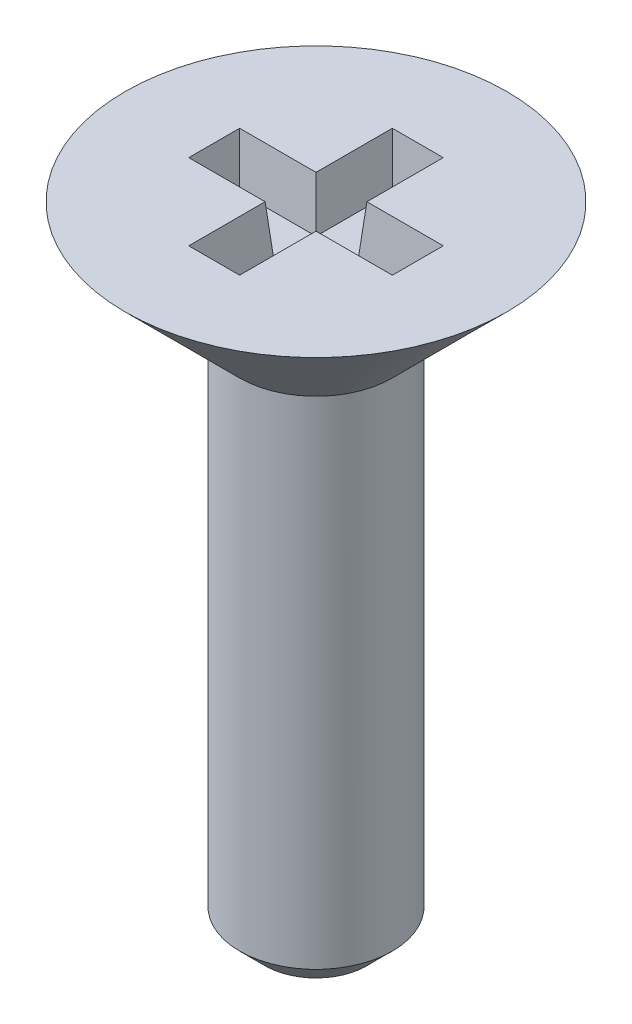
ISO-10303-21;
HEADER;
FILE_DESCRIPTION(('STEP AP214'),'2;1');
FILE_NAME('part.step','',(''),(''),'','','');
FILE_SCHEMA(('AUTOMOTIVE_DESIGN { 1 0 10303 214 1 1 1 1 }'));
ENDSEC;
DATA;
#1=APPLICATION_CONTEXT('core data for automotive mechanical design processes');
#2=APPLICATION_PROTOCOL_DEFINITION('international standard','automotive_design',2000,#1);
#3=PRODUCT_CONTEXT('',#1,'mechanical');
#4=PRODUCT('Part','Part','',(#3));
#5=PRODUCT_RELATED_PRODUCT_CATEGORY('part','',(#4));
#6=PRODUCT_DEFINITION_FORMATION('','',#4);
#7=PRODUCT_DEFINITION_CONTEXT('part definition',#1,'design');
#8=PRODUCT_DEFINITION('design','',#6,#7);
#9=PRODUCT_DEFINITION_SHAPE('','',#8);
#10=(LENGTH_UNIT() NAMED_UNIT(*) SI_UNIT(.MILLI.,.METRE.));
#11=(NAMED_UNIT(*) PLANE_ANGLE_UNIT() SI_UNIT($,.RADIAN.));
#12=(NAMED_UNIT(*) SI_UNIT($,.STERADIAN.) SOLID_ANGLE_UNIT());
#13=UNCERTAINTY_MEASURE_WITH_UNIT(LENGTH_MEASURE(1.E-05),#10,'distance_accuracy_value','');
#14=(GEOMETRIC_REPRESENTATION_CONTEXT(3) GLOBAL_UNCERTAINTY_ASSIGNED_CONTEXT((#13)) GLOBAL_UNIT_ASSIGNED_CONTEXT((#10,
#11,#12)) REPRESENTATION_CONTEXT('',''));
#15=CARTESIAN_POINT('',(0.,0.,0.));
#16=DIRECTION('',(0.,0.,1.));
#17=DIRECTION('',(1.,0.,0.));
#18=AXIS2_PLACEMENT_3D('',#15,#16,#17);
#19=CARTESIAN_POINT('',(0.,0.,0.));
#20=DIRECTION('',(0.,-1.,0.));
#21=DIRECTION('',(0.,0.,-1.));
#22=AXIS2_PLACEMENT_3D('',#19,#20,#21);
#23=PLANE('',#22);
#24=CARTESIAN_POINT('',(0.,0.,0.));
#25=DIRECTION('',(0.,-1.,0.));
#26=DIRECTION('',(0.,0.,-1.));
#27=AXIS2_PLACEMENT_3D('',#24,#25,#26);
#28=CIRCLE('',#27,2.);
#29=CARTESIAN_POINT('',(0.,0.,-2.));
#30=VERTEX_POINT('',#29);
#31=EDGE_CURVE('E11',#30,#30,#28,.T.);
#32=ORIENTED_EDGE('',*,*,#31,.T.);
#33=EDGE_LOOP('',(#32));
#34=FACE_BOUND('',#33,.T.);
#35=ADVANCED_FACE('F30',(#34),#23,.T.);
#36=CARTESIAN_POINT('',(0.,0.,0.));
#37=DIRECTION('',(0.,1.,0.));
#38=DIRECTION('',(0.,0.,1.));
#39=AXIS2_PLACEMENT_3D('',#36,#37,#38);
#40=CYLINDRICAL_SURFACE('',#39,3.);
#41=CARTESIAN_POINT('',(0.,0.999999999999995,0.));
#42=DIRECTION('',(0.,-1.,0.));
#43=DIRECTION('',(0.,0.,-1.));
#44=AXIS2_PLACEMENT_3D('',#41,#42,#43);
#45=CIRCLE('',#44,3.);
#46=CARTESIAN_POINT('',(0.,0.999999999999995,-3.));
#47=VERTEX_POINT('',#46);
#48=EDGE_CURVE('E38',#47,#47,#45,.F.);
#49=ORIENTED_EDGE('',*,*,#48,.T.);
#50=EDGE_LOOP('',(#49));
#51=FACE_BOUND('',#50,.T.);
#52=CARTESIAN_POINT('',(0.,20.5,0.));
#53=DIRECTION('',(0.,1.,0.));
#54=DIRECTION('',(0.,0.,1.));
#55=AXIS2_PLACEMENT_3D('',#52,#53,#54);
#56=CIRCLE('',#55,3.);
#57=CARTESIAN_POINT('',(0.,20.5,3.));
#58=VERTEX_POINT('',#57);
#59=EDGE_CURVE('E226',#58,#58,#56,.T.);
#60=ORIENTED_EDGE('',*,*,#59,.F.);
#61=EDGE_LOOP('',(#60));
#62=FACE_BOUND('',#61,.T.);
#63=ADVANCED_FACE('F231',(#51,#62),#40,.T.);
#64=CARTESIAN_POINT('',(0.,25.,0.));
#65=DIRECTION('',(0.,1.,0.));
#66=DIRECTION('',(0.,0.,1.));
#67=AXIS2_PLACEMENT_3D('',#64,#65,#66);
#68=CONICAL_SURFACE('',#67,7.50000000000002,0.78539816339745);
#69=ORIENTED_EDGE('',*,*,#59,.T.);
#70=EDGE_LOOP('',(#69));
#71=FACE_BOUND('',#70,.T.);
#72=CARTESIAN_POINT('',(0.,25.,0.));
#73=DIRECTION('',(0.,1.,0.));
#74=DIRECTION('',(0.,0.,1.));
#75=AXIS2_PLACEMENT_3D('',#72,#73,#74);
#76=CIRCLE('',#75,7.50000000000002);
#77=CARTESIAN_POINT('',(0.,25.,7.50000000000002));
#78=VERTEX_POINT('',#77);
#79=EDGE_CURVE('E174',#78,#78,#76,.T.);
#80=ORIENTED_EDGE('',*,*,#79,.F.);
#81=EDGE_LOOP('',(#80));
#82=FACE_BOUND('',#81,.T.);
#83=ADVANCED_FACE('F248',(#71,#82),#68,.T.);
#84=CARTESIAN_POINT('',(-7.50000000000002,25.,0.));
#85=DIRECTION('',(0.,1.,0.));
#86=DIRECTION('',(0.,0.,1.));
#87=AXIS2_PLACEMENT_3D('',#84,#85,#86);
#88=PLANE('',#87);
#89=DIRECTION('',(-1.,0.,0.));
#90=VECTOR('',#89,1.);
#91=CARTESIAN_POINT('',(0.999999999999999,25.,-1.));
#92=LINE('',#91,#90);
#93=CARTESIAN_POINT('',(4.,25.,-1.));
#94=VERTEX_POINT('',#93);
#95=CARTESIAN_POINT('',(0.999999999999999,25.,-1.));
#96=VERTEX_POINT('',#95);
#97=EDGE_CURVE('E45',#94,#96,#92,.T.);
#98=ORIENTED_EDGE('',*,*,#97,.F.);
#99=DIRECTION('',(0.,0.,-1.));
#100=VECTOR('',#99,1.);
#101=CARTESIAN_POINT('',(4.,25.,1.));
#102=LINE('',#101,#100);
#103=CARTESIAN_POINT('',(4.,25.,1.));
#104=VERTEX_POINT('',#103);
#105=EDGE_CURVE('E170',#104,#94,#102,.T.);
#106=ORIENTED_EDGE('',*,*,#105,.F.);
#107=DIRECTION('',(1.,0.,0.));
#108=VECTOR('',#107,1.);
#109=CARTESIAN_POINT('',(4.,25.,1.));
#110=LINE('',#109,#108);
#111=CARTESIAN_POINT('',(0.999999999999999,25.,1.));
#112=VERTEX_POINT('',#111);
#113=EDGE_CURVE('E168',#112,#104,#110,.T.);
#114=ORIENTED_EDGE('',*,*,#113,.F.);
#115=DIRECTION('',(0.,0.,-1.));
#116=VECTOR('',#115,1.);
#117=CARTESIAN_POINT('',(0.999999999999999,25.,1.));
#118=LINE('',#117,#116);
#119=CARTESIAN_POINT('',(0.999999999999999,25.,4.));
#120=VERTEX_POINT('',#119);
#121=EDGE_CURVE('E165',#120,#112,#118,.T.);
#122=ORIENTED_EDGE('',*,*,#121,.F.);
#123=DIRECTION('',(1.,0.,0.));
#124=VECTOR('',#123,1.);
#125=CARTESIAN_POINT('',(-1.,25.,4.));
#126=LINE('',#125,#124);
#127=CARTESIAN_POINT('',(-1.,25.,4.));
#128=VERTEX_POINT('',#127);
#129=EDGE_CURVE('E162',#128,#120,#126,.T.);
#130=ORIENTED_EDGE('',*,*,#129,.F.);
#131=DIRECTION('',(0.,0.,1.));
#132=VECTOR('',#131,1.);
#133=CARTESIAN_POINT('',(-1.,25.,4.));
#134=LINE('',#133,#132);
#135=CARTESIAN_POINT('',(-1.,25.,1.));
#136=VERTEX_POINT('',#135);
#137=EDGE_CURVE('E159',#136,#128,#134,.T.);
#138=ORIENTED_EDGE('',*,*,#137,.F.);
#139=DIRECTION('',(1.,0.,0.));
#140=VECTOR('',#139,1.);
#141=CARTESIAN_POINT('',(-1.,25.,1.));
#142=LINE('',#141,#140);
#143=CARTESIAN_POINT('',(-4.,25.,1.));
#144=VERTEX_POINT('',#143);
#145=EDGE_CURVE('E156',#144,#136,#142,.T.);
#146=ORIENTED_EDGE('',*,*,#145,.F.);
#147=DIRECTION('',(0.,0.,1.));
#148=VECTOR('',#147,1.);
#149=CARTESIAN_POINT('',(-4.,25.,1.));
#150=LINE('',#149,#148);
#151=CARTESIAN_POINT('',(-4.,25.,-1.));
#152=VERTEX_POINT('',#151);
#153=EDGE_CURVE('E153',#152,#144,#150,.T.);
#154=ORIENTED_EDGE('',*,*,#153,.F.);
#155=DIRECTION('',(-1.,0.,0.));
#156=VECTOR('',#155,1.);
#157=CARTESIAN_POINT('',(-4.,25.,-1.));
#158=LINE('',#157,#156);
#159=CARTESIAN_POINT('',(-1.,25.,-1.));
#160=VERTEX_POINT('',#159);
#161=EDGE_CURVE('E147',#160,#152,#158,.T.);
#162=ORIENTED_EDGE('',*,*,#161,.F.);
#163=DIRECTION('',(0.,0.,1.));
#164=VECTOR('',#163,1.);
#165=CARTESIAN_POINT('',(-1.,25.,-1.));
#166=LINE('',#165,#164);
#167=CARTESIAN_POINT('',(-1.,25.,-4.));
#168=VERTEX_POINT('',#167);
#169=EDGE_CURVE('E145',#168,#160,#166,.T.);
#170=ORIENTED_EDGE('',*,*,#169,.F.);
#171=DIRECTION('',(-1.,0.,0.));
#172=VECTOR('',#171,1.);
#173=CARTESIAN_POINT('',(-1.,25.,-4.));
#174=LINE('',#173,#172);
#175=CARTESIAN_POINT('',(0.999999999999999,25.,-4.));
#176=VERTEX_POINT('',#175);
#177=EDGE_CURVE('E128',#176,#168,#174,.T.);
#178=ORIENTED_EDGE('',*,*,#177,.F.);
#179=DIRECTION('',(0.,0.,-1.));
#180=VECTOR('',#179,1.);
#181=CARTESIAN_POINT('',(0.999999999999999,25.,-4.));
#182=LINE('',#181,#180);
#183=EDGE_CURVE('E137',#96,#176,#182,.T.);
#184=ORIENTED_EDGE('',*,*,#183,.F.);
#185=EDGE_LOOP('',(#98,#106,#114,#122,#130,#138,#146,#154,#162,#170,#178,#184));
#186=FACE_BOUND('',#185,.T.);
#187=ORIENTED_EDGE('',*,*,#79,.T.);
#188=EDGE_LOOP('',(#187));
#189=FACE_BOUND('',#188,.T.);
#190=ADVANCED_FACE('F141',(#186,#189),#88,.T.);
#191=CARTESIAN_POINT('',(0.999999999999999,25.,-1.));
#192=DIRECTION('',(0.,-0.0871557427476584,-0.996194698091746));
#193=DIRECTION('',(0.,0.996194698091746,-0.0871557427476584));
#194=AXIS2_PLACEMENT_3D('',#191,#192,#193);
#195=PLANE('',#194);
#196=ORIENTED_EDGE('',*,*,#97,.T.);
#197=DIRECTION('',(0.0868265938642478,0.992432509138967,-0.0868265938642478));
#198=VECTOR('',#197,1.);
#199=CARTESIAN_POINT('',(1.0226165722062,25.2585086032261,-1.0226165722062));
#200=LINE('',#199,#198);
#201=CARTESIAN_POINT('',(0.825022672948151,23.,-0.825022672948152));
#202=VERTEX_POINT('',#201);
#203=EDGE_CURVE('E88',#202,#96,#200,.T.);
#204=ORIENTED_EDGE('',*,*,#203,.F.);
#205=DIRECTION('',(-1.,0.,0.));
#206=VECTOR('',#205,1.);
#207=CARTESIAN_POINT('',(4.,23.,-0.825022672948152));
#208=LINE('',#207,#206);
#209=CARTESIAN_POINT('',(3.82502267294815,23.,-0.825022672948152));
#210=VERTEX_POINT('',#209);
#211=EDGE_CURVE('E172',#210,#202,#208,.T.);
#212=ORIENTED_EDGE('',*,*,#211,.F.);
#213=DIRECTION('',(0.0868265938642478,0.992432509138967,-0.0868265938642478));
#214=VECTOR('',#213,1.);
#215=CARTESIAN_POINT('',(3.98492228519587,24.8276609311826,-0.984922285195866));
#216=LINE('',#215,#214);
#217=EDGE_CURVE('E53',#210,#94,#216,.T.);
#218=ORIENTED_EDGE('',*,*,#217,.T.);
#219=EDGE_LOOP('',(#196,#204,#212,#218));
#220=FACE_BOUND('',#219,.T.);
#221=ADVANCED_FACE('F256',(#220),#195,.F.);
#222=CARTESIAN_POINT('',(4.,25.,1.));
#223=DIRECTION('',(0.996194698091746,-0.0871557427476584,0.));
#224=DIRECTION('',(0.0871557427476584,0.996194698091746,0.));
#225=AXIS2_PLACEMENT_3D('',#222,#223,#224);
#226=PLANE('',#225);
#227=ORIENTED_EDGE('',*,*,#105,.T.);
#228=ORIENTED_EDGE('',*,*,#217,.F.);
#229=DIRECTION('',(0.,0.,-1.));
#230=VECTOR('',#229,1.);
#231=CARTESIAN_POINT('',(3.82502267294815,23.,-1.));
#232=LINE('',#231,#230);
#233=CARTESIAN_POINT('',(3.82502267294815,23.,0.825022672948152));
#234=VERTEX_POINT('',#233);
#235=EDGE_CURVE('E175',#234,#210,#232,.T.);
#236=ORIENTED_EDGE('',*,*,#235,.F.);
#237=DIRECTION('',(0.0868265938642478,0.992432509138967,0.0868265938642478));
#238=VECTOR('',#237,1.);
#239=CARTESIAN_POINT('',(4.,25.,1.));
#240=LINE('',#239,#238);
#241=EDGE_CURVE('E93',#234,#104,#240,.T.);
#242=ORIENTED_EDGE('',*,*,#241,.T.);
#243=EDGE_LOOP('',(#227,#228,#236,#242));
#244=FACE_BOUND('',#243,.T.);
#245=ADVANCED_FACE('F257',(#244),#226,.F.);
#246=CARTESIAN_POINT('',(4.,25.,1.));
#247=DIRECTION('',(0.,-0.0871557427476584,0.996194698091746));
#248=DIRECTION('',(0.,-0.996194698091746,-0.0871557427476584));
#249=AXIS2_PLACEMENT_3D('',#246,#247,#248);
#250=PLANE('',#249);
#251=ORIENTED_EDGE('',*,*,#113,.T.);
#252=ORIENTED_EDGE('',*,*,#241,.F.);
#253=DIRECTION('',(1.,0.,0.));
#254=VECTOR('',#253,1.);
#255=CARTESIAN_POINT('',(4.,23.,0.825022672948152));
#256=LINE('',#255,#254);
#257=CARTESIAN_POINT('',(0.825022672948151,23.,0.825022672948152));
#258=VERTEX_POINT('',#257);
#259=EDGE_CURVE('E198',#258,#234,#256,.T.);
#260=ORIENTED_EDGE('',*,*,#259,.F.);
#261=DIRECTION('',(0.0868265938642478,0.992432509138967,0.0868265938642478));
#262=VECTOR('',#261,1.);
#263=CARTESIAN_POINT('',(1.0226165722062,25.2585086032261,1.0226165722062));
#264=LINE('',#263,#262);
#265=EDGE_CURVE('E190',#258,#112,#264,.T.);
#266=ORIENTED_EDGE('',*,*,#265,.T.);
#267=EDGE_LOOP('',(#251,#252,#260,#266));
#268=FACE_BOUND('',#267,.T.);
#269=ADVANCED_FACE('F260',(#268),#250,.F.);
#270=CARTESIAN_POINT('',(0.999999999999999,25.,1.));
#271=DIRECTION('',(0.996194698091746,-0.0871557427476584,0.));
#272=DIRECTION('',(0.0871557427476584,0.996194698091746,0.));
#273=AXIS2_PLACEMENT_3D('',#270,#271,#272);
#274=PLANE('',#273);
#275=ORIENTED_EDGE('',*,*,#121,.T.);
#276=ORIENTED_EDGE('',*,*,#265,.F.);
#277=DIRECTION('',(0.,0.,-1.));
#278=VECTOR('',#277,1.);
#279=CARTESIAN_POINT('',(0.82502267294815,23.,-1.));
#280=LINE('',#279,#278);
#281=CARTESIAN_POINT('',(0.825022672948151,23.,3.82502267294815));
#282=VERTEX_POINT('',#281);
#283=EDGE_CURVE('E201',#282,#258,#280,.T.);
#284=ORIENTED_EDGE('',*,*,#283,.F.);
#285=DIRECTION('',(0.0868265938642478,0.992432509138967,0.0868265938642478));
#286=VECTOR('',#285,1.);
#287=CARTESIAN_POINT('',(0.984922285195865,24.8276609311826,3.98492228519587));
#288=LINE('',#287,#286);
#289=EDGE_CURVE('E188',#282,#120,#288,.T.);
#290=ORIENTED_EDGE('',*,*,#289,.T.);
#291=EDGE_LOOP('',(#275,#276,#284,#290));
#292=FACE_BOUND('',#291,.T.);
#293=ADVANCED_FACE('F263',(#292),#274,.F.);
#294=CARTESIAN_POINT('',(-1.,25.,4.));
#295=DIRECTION('',(0.,-0.0871557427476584,0.996194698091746));
#296=DIRECTION('',(0.,-0.996194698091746,-0.0871557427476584));
#297=AXIS2_PLACEMENT_3D('',#294,#295,#296);
#298=PLANE('',#297);
#299=ORIENTED_EDGE('',*,*,#129,.T.);
#300=ORIENTED_EDGE('',*,*,#289,.F.);
#301=DIRECTION('',(1.,0.,0.));
#302=VECTOR('',#301,1.);
#303=CARTESIAN_POINT('',(4.,23.,3.82502267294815));
#304=LINE('',#303,#302);
#305=CARTESIAN_POINT('',(-0.825022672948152,23.,3.82502267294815));
#306=VERTEX_POINT('',#305);
#307=EDGE_CURVE('E204',#306,#282,#304,.T.);
#308=ORIENTED_EDGE('',*,*,#307,.F.);
#309=DIRECTION('',(-0.0868265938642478,0.992432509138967,0.0868265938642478));
#310=VECTOR('',#309,1.);
#311=CARTESIAN_POINT('',(-1.,25.,4.));
#312=LINE('',#311,#310);
#313=EDGE_CURVE('E186',#306,#128,#312,.T.);
#314=ORIENTED_EDGE('',*,*,#313,.T.);
#315=EDGE_LOOP('',(#299,#300,#308,#314));
#316=FACE_BOUND('',#315,.T.);
#317=ADVANCED_FACE('F267',(#316),#298,.F.);
#318=CARTESIAN_POINT('',(-1.,25.,4.));
#319=DIRECTION('',(-0.996194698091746,-0.0871557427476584,0.));
#320=DIRECTION('',(0.0871557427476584,-0.996194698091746,0.));
#321=AXIS2_PLACEMENT_3D('',#318,#319,#320);
#322=PLANE('',#321);
#323=ORIENTED_EDGE('',*,*,#137,.T.);
#324=ORIENTED_EDGE('',*,*,#313,.F.);
#325=DIRECTION('',(0.,0.,1.));
#326=VECTOR('',#325,1.);
#327=CARTESIAN_POINT('',(-0.825022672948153,23.,-1.));
#328=LINE('',#327,#326);
#329=CARTESIAN_POINT('',(-0.825022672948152,23.,0.825022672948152));
#330=VERTEX_POINT('',#329);
#331=EDGE_CURVE('E207',#330,#306,#328,.T.);
#332=ORIENTED_EDGE('',*,*,#331,.F.);
#333=DIRECTION('',(-0.0868265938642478,0.992432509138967,0.0868265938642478));
#334=VECTOR('',#333,1.);
#335=CARTESIAN_POINT('',(-1.0226165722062,25.2585086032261,1.0226165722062));
#336=LINE('',#335,#334);
#337=EDGE_CURVE('E184',#330,#136,#336,.T.);
#338=ORIENTED_EDGE('',*,*,#337,.T.);
#339=EDGE_LOOP('',(#323,#324,#332,#338));
#340=FACE_BOUND('',#339,.T.);
#341=ADVANCED_FACE('F271',(#340),#322,.F.);
#342=CARTESIAN_POINT('',(-1.,25.,1.));
#343=DIRECTION('',(0.,-0.0871557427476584,0.996194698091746));
#344=DIRECTION('',(0.,-0.996194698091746,-0.0871557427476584));
#345=AXIS2_PLACEMENT_3D('',#342,#343,#344);
#346=PLANE('',#345);
#347=ORIENTED_EDGE('',*,*,#145,.T.);
#348=ORIENTED_EDGE('',*,*,#337,.F.);
#349=DIRECTION('',(1.,0.,0.));
#350=VECTOR('',#349,1.);
#351=CARTESIAN_POINT('',(4.,23.,0.825022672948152));
#352=LINE('',#351,#350);
#353=CARTESIAN_POINT('',(-3.82502267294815,23.,0.825022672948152));
#354=VERTEX_POINT('',#353);
#355=EDGE_CURVE('E210',#354,#330,#352,.T.);
#356=ORIENTED_EDGE('',*,*,#355,.F.);
#357=DIRECTION('',(-0.0868265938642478,0.992432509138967,0.0868265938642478));
#358=VECTOR('',#357,1.);
#359=CARTESIAN_POINT('',(-4.,25.,1.));
#360=LINE('',#359,#358);
#361=EDGE_CURVE('E182',#354,#144,#360,.T.);
#362=ORIENTED_EDGE('',*,*,#361,.T.);
#363=EDGE_LOOP('',(#347,#348,#356,#362));
#364=FACE_BOUND('',#363,.T.);
#365=ADVANCED_FACE('F275',(#364),#346,.F.);
#366=CARTESIAN_POINT('',(-4.,25.,1.));
#367=DIRECTION('',(-0.996194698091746,-0.0871557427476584,0.));
#368=DIRECTION('',(0.0871557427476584,-0.996194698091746,0.));
#369=AXIS2_PLACEMENT_3D('',#366,#367,#368);
#370=PLANE('',#369);
#371=ORIENTED_EDGE('',*,*,#153,.T.);
#372=ORIENTED_EDGE('',*,*,#361,.F.);
#373=DIRECTION('',(0.,0.,1.));
#374=VECTOR('',#373,1.);
#375=CARTESIAN_POINT('',(-3.82502267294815,23.,-1.));
#376=LINE('',#375,#374);
#377=CARTESIAN_POINT('',(-3.82502267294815,23.,-0.825022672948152));
#378=VERTEX_POINT('',#377);
#379=EDGE_CURVE('E213',#378,#354,#376,.T.);
#380=ORIENTED_EDGE('',*,*,#379,.F.);
#381=DIRECTION('',(-0.0868265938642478,0.992432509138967,-0.0868265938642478));
#382=VECTOR('',#381,1.);
#383=CARTESIAN_POINT('',(-4.,25.,-1.));
#384=LINE('',#383,#382);
#385=EDGE_CURVE('E180',#378,#152,#384,.T.);
#386=ORIENTED_EDGE('',*,*,#385,.T.);
#387=EDGE_LOOP('',(#371,#372,#380,#386));
#388=FACE_BOUND('',#387,.T.);
#389=ADVANCED_FACE('F279',(#388),#370,.F.);
#390=CARTESIAN_POINT('',(-4.,25.,-1.));
#391=DIRECTION('',(0.,-0.0871557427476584,-0.996194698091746));
#392=DIRECTION('',(0.,0.996194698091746,-0.0871557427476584));
#393=AXIS2_PLACEMENT_3D('',#390,#391,#392);
#394=PLANE('',#393);
#395=ORIENTED_EDGE('',*,*,#161,.T.);
#396=ORIENTED_EDGE('',*,*,#385,.F.);
#397=DIRECTION('',(-1.,0.,0.));
#398=VECTOR('',#397,1.);
#399=CARTESIAN_POINT('',(4.,23.,-0.825022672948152));
#400=LINE('',#399,#398);
#401=CARTESIAN_POINT('',(-0.825022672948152,23.,-0.825022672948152));
#402=VERTEX_POINT('',#401);
#403=EDGE_CURVE('E216',#402,#378,#400,.T.);
#404=ORIENTED_EDGE('',*,*,#403,.F.);
#405=DIRECTION('',(-0.0868265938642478,0.992432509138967,-0.0868265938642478));
#406=VECTOR('',#405,1.);
#407=CARTESIAN_POINT('',(-1.0226165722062,25.2585086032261,-1.0226165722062));
#408=LINE('',#407,#406);
#409=EDGE_CURVE('E178',#402,#160,#408,.T.);
#410=ORIENTED_EDGE('',*,*,#409,.T.);
#411=EDGE_LOOP('',(#395,#396,#404,#410));
#412=FACE_BOUND('',#411,.T.);
#413=ADVANCED_FACE('F283',(#412),#394,.F.);
#414=CARTESIAN_POINT('',(-1.,25.,-1.));
#415=DIRECTION('',(-0.996194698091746,-0.0871557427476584,0.));
#416=DIRECTION('',(0.0871557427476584,-0.996194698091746,0.));
#417=AXIS2_PLACEMENT_3D('',#414,#415,#416);
#418=PLANE('',#417);
#419=ORIENTED_EDGE('',*,*,#169,.T.);
#420=ORIENTED_EDGE('',*,*,#409,.F.);
#421=DIRECTION('',(0.,0.,1.));
#422=VECTOR('',#421,1.);
#423=CARTESIAN_POINT('',(-0.825022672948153,23.,-1.));
#424=LINE('',#423,#422);
#425=CARTESIAN_POINT('',(-0.825022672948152,23.,-3.82502267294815));
#426=VERTEX_POINT('',#425);
#427=EDGE_CURVE('E219',#426,#402,#424,.T.);
#428=ORIENTED_EDGE('',*,*,#427,.F.);
#429=DIRECTION('',(-0.0868265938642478,0.992432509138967,-0.0868265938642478));
#430=VECTOR('',#429,1.);
#431=CARTESIAN_POINT('',(-1.,25.,-4.));
#432=LINE('',#431,#430);
#433=EDGE_CURVE('E134',#426,#168,#432,.T.);
#434=ORIENTED_EDGE('',*,*,#433,.T.);
#435=EDGE_LOOP('',(#419,#420,#428,#434));
#436=FACE_BOUND('',#435,.T.);
#437=ADVANCED_FACE('F287',(#436),#418,.F.);
#438=CARTESIAN_POINT('',(-1.,25.,-4.));
#439=DIRECTION('',(0.,-0.0871557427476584,-0.996194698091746));
#440=DIRECTION('',(0.,0.996194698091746,-0.0871557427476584));
#441=AXIS2_PLACEMENT_3D('',#438,#439,#440);
#442=PLANE('',#441);
#443=ORIENTED_EDGE('',*,*,#177,.T.);
#444=ORIENTED_EDGE('',*,*,#433,.F.);
#445=DIRECTION('',(-1.,0.,0.));
#446=VECTOR('',#445,1.);
#447=CARTESIAN_POINT('',(4.,23.,-3.82502267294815));
#448=LINE('',#447,#446);
#449=CARTESIAN_POINT('',(0.825022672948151,23.,-3.82502267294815));
#450=VERTEX_POINT('',#449);
#451=EDGE_CURVE('E131',#450,#426,#448,.T.);
#452=ORIENTED_EDGE('',*,*,#451,.F.);
#453=DIRECTION('',(0.0868265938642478,0.992432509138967,-0.0868265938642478));
#454=VECTOR('',#453,1.);
#455=CARTESIAN_POINT('',(0.999999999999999,25.,-4.));
#456=LINE('',#455,#454);
#457=EDGE_CURVE('E124',#450,#176,#456,.T.);
#458=ORIENTED_EDGE('',*,*,#457,.T.);
#459=EDGE_LOOP('',(#443,#444,#452,#458));
#460=FACE_BOUND('',#459,.T.);
#461=ADVANCED_FACE('F126',(#460),#442,.F.);
#462=CARTESIAN_POINT('',(0.999999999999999,25.,-4.));
#463=DIRECTION('',(0.996194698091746,-0.0871557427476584,0.));
#464=DIRECTION('',(0.0871557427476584,0.996194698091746,0.));
#465=AXIS2_PLACEMENT_3D('',#462,#463,#464);
#466=PLANE('',#465);
#467=ORIENTED_EDGE('',*,*,#183,.T.);
#468=ORIENTED_EDGE('',*,*,#457,.F.);
#469=DIRECTION('',(0.,0.,-1.));
#470=VECTOR('',#469,1.);
#471=CARTESIAN_POINT('',(0.82502267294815,23.,-1.));
#472=LINE('',#471,#470);
#473=EDGE_CURVE('E195',#202,#450,#472,.T.);
#474=ORIENTED_EDGE('',*,*,#473,.F.);
#475=ORIENTED_EDGE('',*,*,#203,.T.);
#476=EDGE_LOOP('',(#467,#468,#474,#475));
#477=FACE_BOUND('',#476,.T.);
#478=ADVANCED_FACE('F138',(#477),#466,.F.);
#479=CARTESIAN_POINT('',(4.,23.,-1.));
#480=DIRECTION('',(0.,1.,0.));
#481=DIRECTION('',(0.,0.,1.));
#482=AXIS2_PLACEMENT_3D('',#479,#480,#481);
#483=PLANE('',#482);
#484=ORIENTED_EDGE('',*,*,#211,.T.);
#485=ORIENTED_EDGE('',*,*,#473,.T.);
#486=ORIENTED_EDGE('',*,*,#451,.T.);
#487=ORIENTED_EDGE('',*,*,#427,.T.);
#488=ORIENTED_EDGE('',*,*,#403,.T.);
#489=ORIENTED_EDGE('',*,*,#379,.T.);
#490=ORIENTED_EDGE('',*,*,#355,.T.);
#491=ORIENTED_EDGE('',*,*,#331,.T.);
#492=ORIENTED_EDGE('',*,*,#307,.T.);
#493=ORIENTED_EDGE('',*,*,#283,.T.);
#494=ORIENTED_EDGE('',*,*,#259,.T.);
#495=ORIENTED_EDGE('',*,*,#235,.T.);
#496=EDGE_LOOP('',(#484,#485,#486,#487,#488,#489,#490,#491,#492,#493,#494,#495));
#497=FACE_BOUND('',#496,.T.);
#498=ADVANCED_FACE('F235',(#497),#483,.T.);
#499=CARTESIAN_POINT('',(0.,0.999999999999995,0.));
#500=DIRECTION('',(0.,1.,0.));
#501=DIRECTION('',(0.,0.,1.));
#502=AXIS2_PLACEMENT_3D('',#499,#500,#501);
#503=CONICAL_SURFACE('',#502,3.,0.78539816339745);
#504=ORIENTED_EDGE('',*,*,#31,.F.);
#505=EDGE_LOOP('',(#504));
#506=FACE_BOUND('',#505,.T.);
#507=ORIENTED_EDGE('',*,*,#48,.F.);
#508=EDGE_LOOP('',(#507));
#509=FACE_BOUND('',#508,.T.);
#510=ADVANCED_FACE('F32',(#506,#509),#503,.T.);
#511=CLOSED_SHELL('',(#35,#63,#83,#190,#221,#245,#269,#293,#317,#341,#365,#389,#413,#437,#461,
#478,#498,#510));
#512=MANIFOLD_SOLID_BREP('B2',#511);
#513=ADVANCED_BREP_SHAPE_REPRESENTATION('',(#18,#512),#14);
#514=SHAPE_DEFINITION_REPRESENTATION(#9,#513);
ENDSEC;
END-ISO-10303-21;
